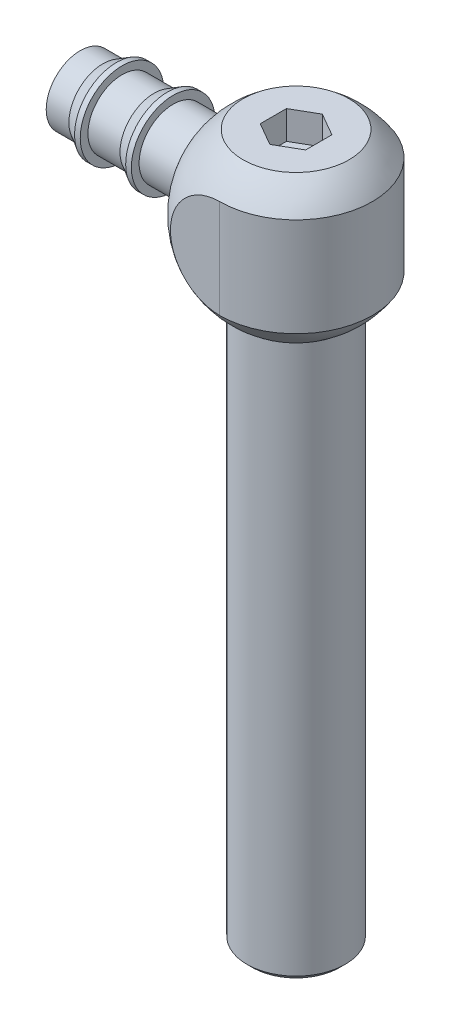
from build123d import *

# Parameters (mm, degrees)
CUT_EXTRUDE1_DEPTH      = 34.842157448
CUT_EXTRUDE1_DEPTH_BACK = 34.842157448
SKETCH3_OUTSIDE_W       = 36.198
SKETCH3_OUTSIDE_H       = 36.198
CUT_EXTRUDE2_DEPTH      = 33.408703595
CUT_EXTRUDE2_DEPTH_BACK = 33.408703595
SKETCH4_OUTSIDE_W       = 31.224
SKETCH4_OUTSIDE_H       = 35.288
SKETCH4_OUTSIDE_W_2     = 38.1
SKETCH4_OUTSIDE_H_2     = 20.6375
FILLET1_R               = 1.190625
CUT_EXTRUDE3_START      = -30.1625
SKETCH10_R              = 3.4925
CUT_EXTRUDE3_DEPTH      = 30.1625
CUT_EXTRUDE4_DEPTH      = 3.96875
SKETCH18_R              = 4.7625
CUT_EXTRUDE5_DEPTH      = 91.59875


with BuildPart() as part:
    # Sketch1 → Revolve1 (revolve)
    with BuildSketch(Plane.XY):
        with BuildLine():
            Line((0, 28.68295), (0, 3.28295))
            ThreePointArc((0, 3.28295), (12.7, 15.98295), (0, 28.68295))
        make_face()
    revolve(axis=Axis((0, 0, 0), (0, 1, 0)))

    # Sketch3 outside → Cut-Extrude1 (cut, two sides: drawn at the far end of the back side and taken through both)
    with BuildSketch(Plane(origin=(0, 0, 0), x_dir=(1, 0, 0), z_dir=(0, 1, 0)).offset(-CUT_EXTRUDE1_DEPTH_BACK)):
        Rectangle(SKETCH3_OUTSIDE_W, SKETCH3_OUTSIDE_H)
        with BuildLine():
            Line((0, -10.668), (-10.668, -10.668))
            Line((-10.668, -10.668), (-10.668, 10.668))
            Line((-10.668, 10.668), (0, 10.668))
            ThreePointArc((0, 10.668), (10.668, 0), (0, -10.668))
        make_face(mode=Mode.SUBTRACT)
    extrude(amount=CUT_EXTRUDE1_DEPTH + CUT_EXTRUDE1_DEPTH_BACK, mode=Mode.SUBTRACT)

    # Sketch4 outside → Cut-Extrude2 (cut, two sides: drawn at the far end of the back side and taken through both)
    with BuildSketch(Plane.XY.offset(-CUT_EXTRUDE2_DEPTH_BACK)):
        with Locations((0, 15.983)):
            Rectangle(SKETCH4_OUTSIDE_W, SKETCH4_OUTSIDE_H)
        with Locations((0, 15.98295)):
            Rectangle(SKETCH4_OUTSIDE_W_2, SKETCH4_OUTSIDE_H_2, mode=Mode.SUBTRACT)
    extrude(amount=CUT_EXTRUDE2_DEPTH + CUT_EXTRUDE2_DEPTH_BACK, mode=Mode.SUBTRACT)

    # Sketch9 → Revolve2 (revolve)
    with BuildSketch(Plane(origin=(0, 15.98295, 0), x_dir=(1, 0, 0), z_dir=(0, 1, 0)), mode=Mode.PRIVATE) as revolve2_sk:
        Polygon((-30.1625, 0), (-30.1625, 4.7625), (-26.9875, 4.7625), (-25.117751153, 5.842), (-24.324001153, 5.842), (-24.324001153, 4.7625), (-19.84375, 4.7625), (-17.974001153, 5.842), (-17.180251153, 5.842), (-17.180251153, 4.7625), (0, 4.7625), (0, 0), align=None)
    revolve(revolve2_sk.sketch.rotate(Axis((0, 15.98295, 0), (1, 0, 0)), 180), axis=Axis((0, 15.98295, 0), (1, 0, 0)))

    # Fillet1
    fillet1_edges = [part.edges().sort_by_distance(p)[0] for p in [
        (-10.668, 15.98295, -4.7625),
    ]]
    fillet(fillet1_edges, radius=FILLET1_R)

    # Sketch10 → Cut-Extrude3 (cut)
    with BuildSketch(Plane.ZY.offset(30.1625).offset(CUT_EXTRUDE3_START)):
        with Locations((0, 15.98295)):
            Circle(SKETCH10_R)
    extrude(amount=CUT_EXTRUDE3_DEPTH, mode=Mode.SUBTRACT)

    # Sketch16 → Revolve3 (revolve)
    with BuildSketch(Plane.XY, mode=Mode.PRIVATE) as revolve3_sk:
        Polygon((0, 5.6642), (6.858, 5.6642), (6.858, 2.4892), (6.858, -71.3613), (6.096, -72.1233), (0, -72.1233), align=None)
    revolve(revolve3_sk.sketch.rotate(Axis((0, -23.677456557, 0), (0, -1, 0)), 180), axis=Axis((0, -23.677456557, 0), (0, -1, 0)))

    # Sketch17 → Cut-Extrude4 (cut)
    with BuildSketch(Plane(origin=(0, 26.3017, 0), x_dir=(1, 0, 0), z_dir=(0, 1, 0))):
        Polygon((3.175, 1.833087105), (0, 3.666174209), (-3.175, 1.833087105), (-3.175, -1.833087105), (0, -3.666174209), (3.175, -1.833087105), align=None)
    extrude(amount=-CUT_EXTRUDE4_DEPTH, mode=Mode.SUBTRACT)

    # Sketch18 → Cut-Extrude5 (cut)
    with BuildSketch(Plane.XZ.offset(72.1233)):
        Circle(SKETCH18_R)
    extrude(amount=-CUT_EXTRUDE5_DEPTH, mode=Mode.SUBTRACT)


solid = part.part
